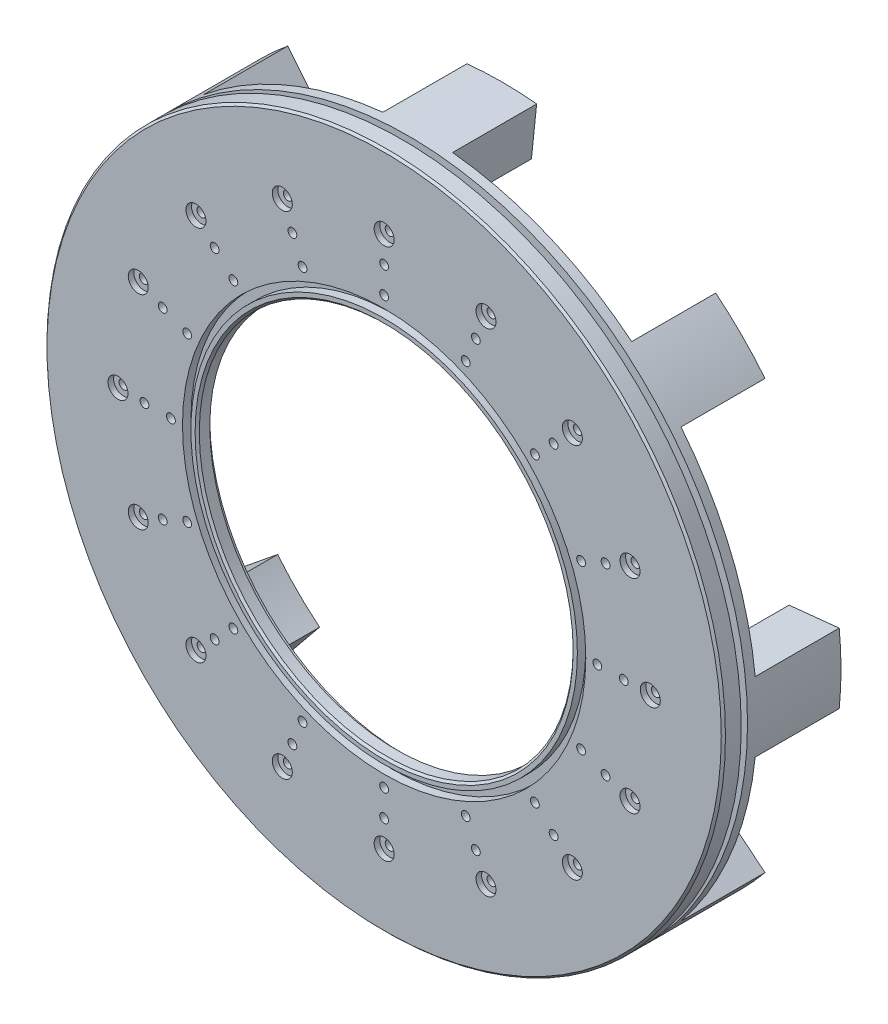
from build123d import *

# Parameters (mm, degrees)
SKETCH1_R                                           = 161.5
SKETCH1_R_2                                         = 137.5
BOSS_EXTRUDE1_DEPTH                                 = 50
SKETCH2_R                                           = 161.5
SKETCH2_R_2                                         = 89
BOSS_EXTRUDE2_DEPTH                                 = 6
SKETCH3_R                                           = 6.35
CUT_EXTRUDE1_DEPTH                                  = 30
SKETCH4_R                                           = 96
SKETCH4_R_2                                         = 92
BOSS_EXTRUDE3_DEPTH                                 = 3
SKETCH5_R                                           = 123
SKETCH5_R_2                                         = 119
BOSS_EXTRUDE4_DEPTH                                 = 3
M5X0_8_TAPPED_HOLE2_AT_2_COUNT                      = 2
M5X0_8_TAPPED_HOLE2_AT_2_PITCH                      = 12.6
CBORE_FOR_8_BINDING_HEAD_MACHINE_SCREW2_D           = 4.3053
CBORE_FOR_8_BINDING_HEAD_MACHINE_SCREW2_CBORE_D     = 9.525
CBORE_FOR_8_BINDING_HEAD_MACHINE_SCREW2_CBORE_DEPTH = 2.667
CIRPATTERN2_COUNT                                   = 16
SKETCH14_R                                          = 165
SKETCH14_R_2                                        = 147.5
CUT_EXTRUDE2_DEPTH                                  = 1.5
SKETCH15_R                                          = 96
SKETCH15_R_2                                        = 92
CUT_EXTRUDE3_DEPTH                                  = 4
CUT_EXTRUDE4_DEPTH                                  = 40
CIRPATTERN7_COUNT                                   = 8
SKETCH19_R                                          = 6.731
CUT_EXTRUDE6_DEPTH                                  = 1.016
CIRPATTERN8_COUNT                                   = 8
FILLET1_R                                           = 1
CHAMFER1_SIZE                                       = 1


with BuildPart() as part:
    # Sketch1 → Boss-Extrude1 (new body)
    with BuildSketch(Plane.XY):
        Circle(SKETCH1_R)
        Circle(SKETCH1_R_2, mode=Mode.SUBTRACT)
    extrude(amount=BOSS_EXTRUDE1_DEPTH)

    # Sketch2 → Boss-Extrude2 (add)
    with BuildSketch(Plane.XY.offset(50)):
        Circle(SKETCH2_R)
        Circle(SKETCH2_R_2, mode=Mode.SUBTRACT)
    extrude(amount=BOSS_EXTRUDE2_DEPTH)

    # Sketch3 → Cut-Extrude1 (cut)
    with BuildSketch(Plane(origin=(0, 0, 0), x_dir=(-1, 0, 0), z_dir=(0, 0, -1))):
        with Locations((0, 148)):
            Circle(SKETCH3_R)
    cut_extrude1 = extrude(amount=-CUT_EXTRUDE1_DEPTH, mode=Mode.SUBTRACT)

    # Sketch4 → Boss-Extrude3 (add)
    with BuildSketch(Plane(origin=(0, 0, 50), x_dir=(-1, 0, 0), z_dir=(0, 0, -1))):
        with Locations(Location((0, 0, 0), (0, 0, 180))):
            Circle(SKETCH4_R)
        Circle(SKETCH4_R_2, mode=Mode.SUBTRACT)
    extrude(amount=BOSS_EXTRUDE3_DEPTH)

    # Sketch5 → Boss-Extrude4 (add)
    with BuildSketch(Plane(origin=(0, 0, 50), x_dir=(-1, 0, 0), z_dir=(0, 0, -1))):
        with Locations(Location((0, 0, 0), (0, 0, 180))):
            Circle(SKETCH5_R)
        Circle(SKETCH5_R_2, mode=Mode.SUBTRACT)
    extrude(amount=BOSS_EXTRUDE4_DEPTH)

    # Sketch11 → M5x0.8 Tapped Hole2 (revolve, cut)
    with BuildSketch(Plane(origin=(0, 114.1, 56), x_dir=(0, -1, 0), z_dir=(1, 0, 0))):
        Polygon((0, 0), (0, 8.2618073), (2.1, 7), (2.1, 0), align=None)
    m5x0_8_tapped_hole2 = revolve(axis=Axis((0, 114.1, 62.35), (0, 0, -1)), mode=Mode.SUBTRACT)

    # M5x0.8 Tapped Hole2 at 2: M5x0.8 Tapped Hole2 ×2
    with Locations(*[(0, -i * M5X0_8_TAPPED_HOLE2_AT_2_PITCH, 0) for i in range(1, M5X0_8_TAPPED_HOLE2_AT_2_COUNT)]):
        add(m5x0_8_tapped_hole2, mode=Mode.SUBTRACT)

    # CBORE for _8 Binding Head Machine Screw2 (through all)
    with Locations(Plane(origin=(0, 126.7, 56), x_dir=(1, 0, 0), z_dir=(0, 0, 1))):
        with Locations((0, 0)):
            cbore_for_8_binding_head_machine_screw2 = CounterBoreHole(CBORE_FOR_8_BINDING_HEAD_MACHINE_SCREW2_D / 2, CBORE_FOR_8_BINDING_HEAD_MACHINE_SCREW2_CBORE_D / 2, CBORE_FOR_8_BINDING_HEAD_MACHINE_SCREW2_CBORE_DEPTH)

    # CirPattern2: M5x0.8 Tapped Hole2, CBORE for _8 Binding Head Machine Screw2 ×16 about axis
    cirpattern2_axis = Axis((0, 0, 0), (0, 0, 1))
    add([m5x0_8_tapped_hole2.rotate(cirpattern2_axis, i * 360 / CIRPATTERN2_COUNT) for i in range(1, CIRPATTERN2_COUNT)], mode=Mode.SUBTRACT)
    add([cbore_for_8_binding_head_machine_screw2.rotate(cirpattern2_axis, i * 360 / CIRPATTERN2_COUNT) for i in range(1, CIRPATTERN2_COUNT)], mode=Mode.SUBTRACT)

    # CirPattern2 copy 1 sketch → CirPattern2 copy 1 (revolve, cut)
    with BuildSketch(Plane(origin=(-38.842368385, 93.77377255, 56), x_dir=(0.3826834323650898, -0.9238795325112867, 0), z_dir=(0.9238795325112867, 0.3826834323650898, 0))):
        Polygon((0, 0), (0, 8.2618073), (2.1, 7), (2.1, 0), align=None)
    revolve(axis=Axis((-38.842368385, 93.77377255, 62.35), (0, 0, -1)), mode=Mode.SUBTRACT)

    # CirPattern2 copy 2 sketch → CirPattern2 copy 2 (revolve, cut)
    with BuildSketch(Plane(origin=(-71.77133829, 71.77133829, 56), x_dir=(0.7071067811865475, -0.7071067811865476, 0), z_dir=(0.7071067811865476, 0.7071067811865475, 0))):
        Polygon((0, 0), (0, 8.2618073), (2.1, 7), (2.1, 0), align=None)
    revolve(axis=Axis((-71.77133829, 71.77133829, 62.35), (0, 0, -1)), mode=Mode.SUBTRACT)

    # CirPattern2 copy 3 sketch → CirPattern2 copy 3 (revolve, cut)
    with BuildSketch(Plane(origin=(-93.77377255, 38.842368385, 56), x_dir=(0.9238795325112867, -0.38268343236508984, 0), z_dir=(0.38268343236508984, 0.9238795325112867, 0))):
        Polygon((0, 0), (0, 8.2618073), (2.1, 7), (2.1, 0), align=None)
    revolve(axis=Axis((-93.77377255, 38.842368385, 62.35), (0, 0, -1)), mode=Mode.SUBTRACT)

    # CirPattern2 copy 4 sketch → CirPattern2 copy 4 (revolve, cut)
    with BuildSketch(Plane(origin=(-101.5, 0, 56), x_dir=(1, 0, 0), z_dir=(0, 1, 0))):
        Polygon((0, 0), (0, 8.2618073), (2.1, 7), (2.1, 0), align=None)
    revolve(axis=Axis((-101.5, 0, 62.35), (0, 0, -1)), mode=Mode.SUBTRACT)

    # CirPattern2 copy 5 sketch → CirPattern2 copy 5 (revolve, cut)
    with BuildSketch(Plane(origin=(-93.77377255, -38.842368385, 56), x_dir=(0.9238795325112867, 0.3826834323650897, 0), z_dir=(-0.3826834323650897, 0.9238795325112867, 0))):
        Polygon((0, 0), (0, 8.2618073), (2.1, 7), (2.1, 0), align=None)
    revolve(axis=Axis((-93.77377255, -38.842368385, 62.35), (0, 0, -1)), mode=Mode.SUBTRACT)

    # CirPattern2 copy 6 sketch → CirPattern2 copy 6 (revolve, cut)
    with BuildSketch(Plane(origin=(-71.77133829, -71.77133829, 56), x_dir=(0.7071067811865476, 0.7071067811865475, 0), z_dir=(-0.7071067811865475, 0.7071067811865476, 0))):
        Polygon((0, 0), (0, 8.2618073), (2.1, 7), (2.1, 0), align=None)
    revolve(axis=Axis((-71.77133829, -71.77133829, 62.35), (0, 0, -1)), mode=Mode.SUBTRACT)

    # CirPattern2 copy 7 sketch → CirPattern2 copy 7 (revolve, cut)
    with BuildSketch(Plane(origin=(-38.842368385, -93.77377255, 56), x_dir=(0.3826834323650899, 0.9238795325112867, 0), z_dir=(-0.9238795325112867, 0.3826834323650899, 0))):
        Polygon((0, 0), (0, 8.2618073), (2.1, 7), (2.1, 0), align=None)
    revolve(axis=Axis((-38.842368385, -93.77377255, 62.35), (0, 0, -1)), mode=Mode.SUBTRACT)

    # CirPattern2 copy 8 sketch → CirPattern2 copy 8 (revolve, cut)
    with BuildSketch(Plane(origin=(0, -101.5, 56), x_dir=(0, 1, 0), z_dir=(-1, 0, 0))):
        Polygon((0, 0), (0, 8.2618073), (2.1, 7), (2.1, 0), align=None)
    revolve(axis=Axis((0, -101.5, 62.35), (0, 0, -1)), mode=Mode.SUBTRACT)

    # CirPattern2 copy 9 sketch → CirPattern2 copy 9 (revolve, cut)
    with BuildSketch(Plane(origin=(38.842368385, -93.77377255, 56), x_dir=(-0.38268343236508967, 0.9238795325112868, 0), z_dir=(-0.9238795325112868, -0.38268343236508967, 0))):
        Polygon((0, 0), (0, 8.2618073), (2.1, 7), (2.1, 0), align=None)
    revolve(axis=Axis((38.842368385, -93.77377255, 62.35), (0, 0, -1)), mode=Mode.SUBTRACT)

    # CirPattern2 copy 10 sketch → CirPattern2 copy 10 (revolve, cut)
    with BuildSketch(Plane(origin=(71.77133829, -71.77133829, 56), x_dir=(-0.7071067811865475, 0.7071067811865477, 0), z_dir=(-0.7071067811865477, -0.7071067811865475, 0))):
        Polygon((0, 0), (0, 8.2618073), (2.1, 7), (2.1, 0), align=None)
    revolve(axis=Axis((71.77133829, -71.77133829, 62.35), (0, 0, -1)), mode=Mode.SUBTRACT)

    # CirPattern2 copy 11 sketch → CirPattern2 copy 11 (revolve, cut)
    with BuildSketch(Plane(origin=(93.77377255, -38.842368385, 56), x_dir=(-0.9238795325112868, 0.3826834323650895, 0), z_dir=(-0.3826834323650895, -0.9238795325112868, 0))):
        Polygon((0, 0), (0, 8.2618073), (2.1, 7), (2.1, 0), align=None)
    revolve(axis=Axis((93.77377255, -38.842368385, 62.35), (0, 0, -1)), mode=Mode.SUBTRACT)

    # CirPattern2 copy 12 sketch → CirPattern2 copy 12 (revolve, cut)
    with BuildSketch(Plane(origin=(101.5, 0, 56), x_dir=(-1, 0, 0), z_dir=(0, -1, 0))):
        Polygon((0, 0), (0, 8.2618073), (2.1, 7), (2.1, 0), align=None)
    revolve(axis=Axis((101.5, 0, 62.35), (0, 0, -1)), mode=Mode.SUBTRACT)

    # CirPattern2 copy 13 sketch → CirPattern2 copy 13 (revolve, cut)
    with BuildSketch(Plane(origin=(93.77377255, 38.842368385, 56), x_dir=(-0.9238795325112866, -0.38268343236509, 0), z_dir=(0.38268343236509, -0.9238795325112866, 0))):
        Polygon((0, 0), (0, 8.2618073), (2.1, 7), (2.1, 0), align=None)
    revolve(axis=Axis((93.77377255, 38.842368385, 62.35), (0, 0, -1)), mode=Mode.SUBTRACT)

    # CirPattern2 copy 14 sketch → CirPattern2 copy 14 (revolve, cut)
    with BuildSketch(Plane(origin=(71.77133829, 71.77133829, 56), x_dir=(-0.7071067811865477, -0.7071067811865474, 0), z_dir=(0.7071067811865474, -0.7071067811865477, 0))):
        Polygon((0, 0), (0, 8.2618073), (2.1, 7), (2.1, 0), align=None)
    revolve(axis=Axis((71.77133829, 71.77133829, 62.35), (0, 0, -1)), mode=Mode.SUBTRACT)

    # CirPattern2 copy 15 sketch → CirPattern2 copy 15 (revolve, cut)
    with BuildSketch(Plane(origin=(38.842368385, 93.77377255, 56), x_dir=(-0.38268343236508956, -0.9238795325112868, 0), z_dir=(0.9238795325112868, -0.38268343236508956, 0))):
        Polygon((0, 0), (0, 8.2618073), (2.1, 7), (2.1, 0), align=None)
    revolve(axis=Axis((38.842368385, 93.77377255, 62.35), (0, 0, -1)), mode=Mode.SUBTRACT)

    # Sketch14 → Cut-Extrude2 (cut, symmetric)
    with BuildSketch(Plane.XY.offset(46)):
        Circle(SKETCH14_R)
        Circle(SKETCH14_R_2, mode=Mode.SUBTRACT)
    extrude(amount=CUT_EXTRUDE2_DEPTH, both=True, mode=Mode.SUBTRACT)

    # Sketch15 → Cut-Extrude3 (cut)
    with BuildSketch(Plane.XY.offset(56)):
        Circle(SKETCH15_R)
        with Locations(Location((0, 0, 0), (0, 0, 180))):
            Circle(SKETCH15_R_2, mode=Mode.SUBTRACT)
    extrude(amount=-CUT_EXTRUDE3_DEPTH, mode=Mode.SUBTRACT)

    # Sketch16 → Cut-Extrude4 (cut)
    with BuildSketch(Plane(origin=(0, 0, 0), x_dir=(-1, 0, 0), z_dir=(0, 0, -1))):
        Polygon((17.983986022, -174.073479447), (110.371939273, -135.80513621), (84.046695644, -103.413721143), (13.694555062, -132.554531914), align=None)
    cut_extrude4 = extrude(amount=-CUT_EXTRUDE4_DEPTH, mode=Mode.SUBTRACT)

    # CirPattern7: Cut-Extrude4 ×8 about axis
    cirpattern7_axis = Axis((0, 0, 0), (0, 0, 1))
    for i in range(1, CIRPATTERN7_COUNT):
        add(cut_extrude4.rotate(cirpattern7_axis, i * 360 / CIRPATTERN7_COUNT), mode=Mode.SUBTRACT)

    # Sketch19 → Cut-Extrude6 (cut)
    with BuildSketch(Plane(origin=(0, 0, 6.016), x_dir=(-1, 0, 0), z_dir=(0, 0, -1))):
        with Locations((0, 148)):
            Circle(SKETCH19_R)
    cut_extrude6 = extrude(amount=-CUT_EXTRUDE6_DEPTH, mode=Mode.SUBTRACT)

    # CirPattern8: Cut-Extrude1, Cut-Extrude6 ×8 about axis
    cirpattern8_axis = Axis((0, 0, 0), (0, 0, 1))
    add([cut_extrude1.rotate(cirpattern8_axis, i * 360 / CIRPATTERN8_COUNT) for i in range(1, CIRPATTERN8_COUNT)], mode=Mode.SUBTRACT)
    add([cut_extrude6.rotate(cirpattern8_axis, i * 360 / CIRPATTERN8_COUNT) for i in range(1, CIRPATTERN8_COUNT)], mode=Mode.SUBTRACT)

    # Fillet1
    fillet1_edges = [part.edges().sort_by_distance(p)[0] for p in [
        (-137.5, 0, 50),
    ]]
    fillet(fillet1_edges, radius=FILLET1_R)

    # Chamfer1
    chamfer1_edges = [part.edges().sort_by_distance(p)[0] for p in [
        (-89, 0, 56),
        (-161.5, 0, 56),
    ]]
    chamfer(chamfer1_edges, length=CHAMFER1_SIZE)


solid = part.part
